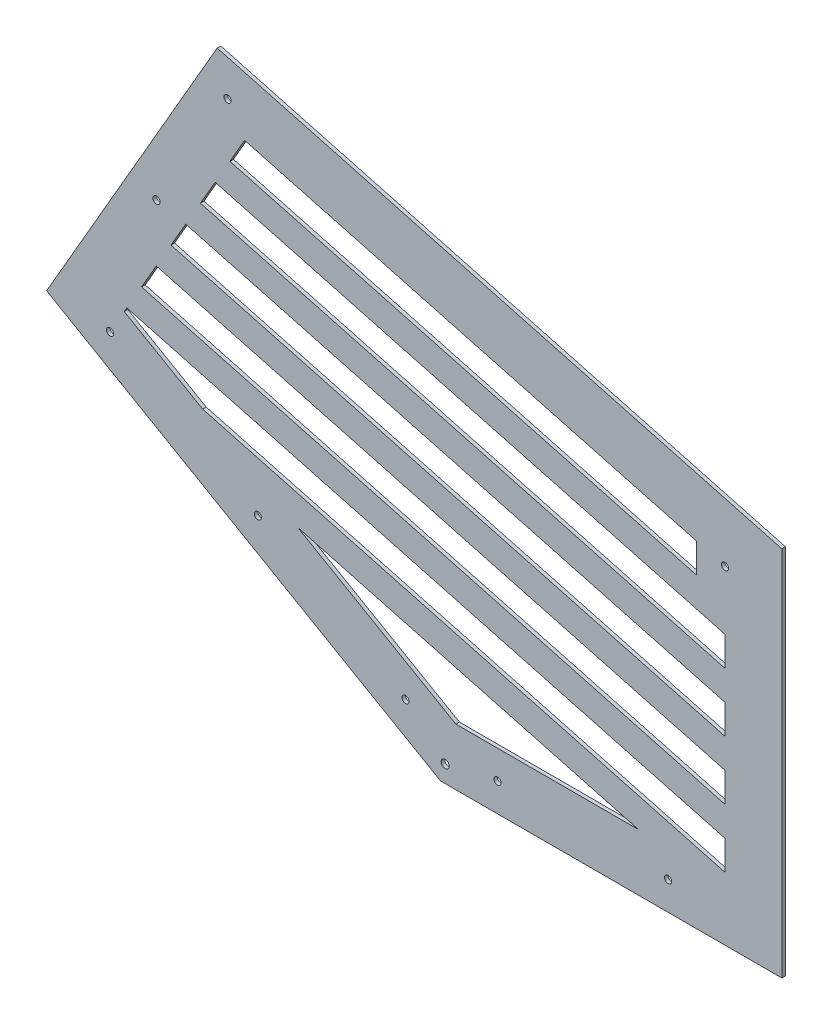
from build123d import *

# Parameters (mm, degrees)
SKETCH_1_R      = 1.7859375
SKETCH_1_R_2    = 1.5875
EXTRUDE_1_DEPTH = 1.5875


with BuildPart() as part:
    # Sketch 1 → Extrude 1 (new body)
    with BuildSketch(Plane.XY):
        Polygon((0, 0), (152.4, 0), (152.4, 166.011818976), (-99.776362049, 233.582271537), (-175.976362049, 101.6), align=None)
        with Locations((2.041772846, 7.62)):
            Circle(SKETCH_1_R, mode=Mode.SUBTRACT)
        with Locations((101.6, 12.7)):
            Circle(SKETCH_1_R_2, mode=Mode.SUBTRACT)
        with Locations((25.4, 12.7)):
            Circle(SKETCH_1_R_2, mode=Mode.SUBTRACT)
        with Locations((-147.629316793, 99.898522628)):
            Circle(SKETCH_1_R_2, mode=Mode.SUBTRACT)
        with Locations((-81.638181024, 61.798522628)):
            Circle(SKETCH_1_R_2, mode=Mode.SUBTRACT)
        with Locations((-15.647045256, 23.698522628)):
            Circle(SKETCH_1_R_2, mode=Mode.SUBTRACT)
        with Locations((-95.127839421, 216.233748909)):
            Circle(SKETCH_1_R_2, mode=Mode.SUBTRACT)
        with Locations((-126.877839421, 161.241135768)):
            Circle(SKETCH_1_R_2, mode=Mode.SUBTRACT)
        with Locations((127, 146.521713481)):
            Circle(SKETCH_1_R_2, mode=Mode.SUBTRACT)
        Polygon((-87.52436954, 204.003345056), (-94.098373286, 192.616836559), (114.3, 136.776660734), (114.3, 149.924668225), align=None, mode=Mode.SUBTRACT)
        Polygon((-141.279316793, 110.897045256), (-106.301504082, 90.702595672), (127, 28.18964606), (127, 41.337653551), (-140.116399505, 112.911277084), align=None, mode=Mode.SUBTRACT)
        Polygon((6.805909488, 25.4), (88.342068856, 25.4), (-63.806475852, 66.168079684), align=None, mode=Mode.SUBTRACT)
        Polygon((-107.246380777, 169.843819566), (127, 107.077691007), (127, 120.225698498), (-100.672377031, 181.230328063), align=None, mode=Mode.SUBTRACT)
        Polygon((-113.820384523, 158.45731107), (127, 93.929683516), (127, 80.781676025), (-120.394388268, 147.070802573), align=None, mode=Mode.SUBTRACT)
        Polygon((-133.542395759, 124.29778558), (127, 54.485661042), (127, 67.633668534), (-126.968392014, 135.684294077), align=None, mode=Mode.SUBTRACT)
    extrude(amount=EXTRUDE_1_DEPTH)


solid = part.part
